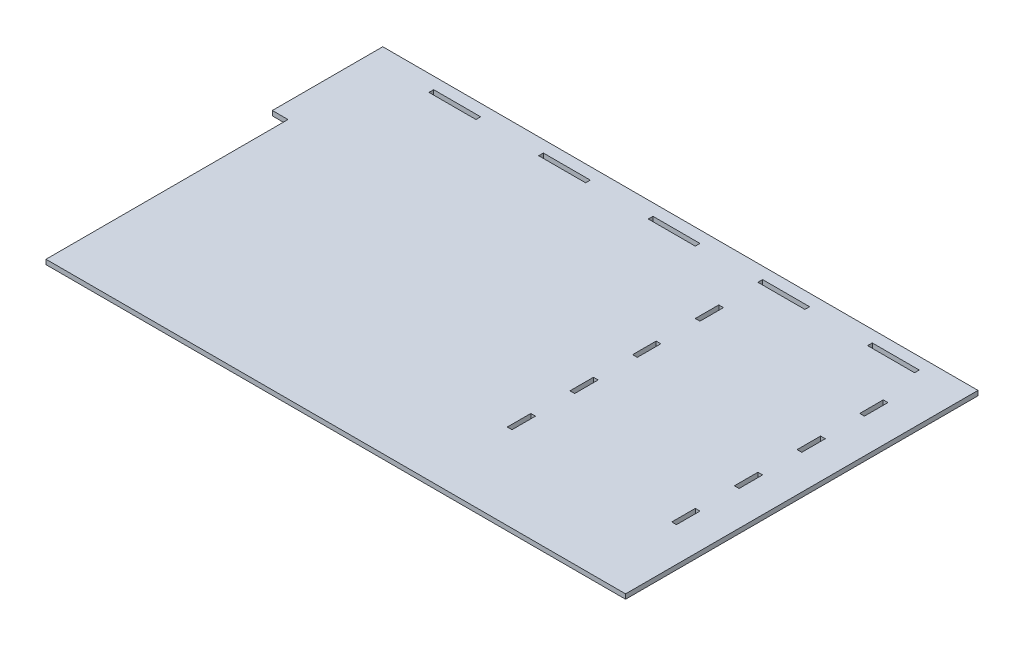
from build123d import *

# Parameters (mm, degrees)
SKETCH1_W           = 390
SKETCH1_H           = 225
BOSS_EXTRUDE1_DEPTH = 3
SKETCH2_W           = 30
SKETCH2_H           = 3
CUT_EXTRUDE1_DEPTH  = 3
SKETCH4_W           = 10
SKETCH4_H           = 225
CUT_EXTRUDE2_DEPTH  = 10
SKETCH9_W           = 10
SKETCH9_H           = 154.5
CUT_EXTRUDE6_DEPTH  = 10
SKETCH10_W          = 3
SKETCH10_H          = 15
CUT_EXTRUDE7_DEPTH  = 10


with BuildPart() as part:
    # Sketch1 → Boss-Extrude1 (new body)
    with BuildSketch(Plane(origin=(0, 0, 0), x_dir=(1, 0, 0), z_dir=(0, 1, 0))):
        with Locations((195, 112.5)):
            Rectangle(SKETCH1_W, SKETCH1_H)
    extrude(amount=BOSS_EXTRUDE1_DEPTH)

    # Sketch2 → Cut-Extrude1 (cut)
    with BuildSketch(Plane(origin=(0, 3, 0), x_dir=(1, 0, 0), z_dir=(0, 1, 0))):
        with Locations((55, 216)):
            Rectangle(SKETCH2_W, SKETCH2_H)
        with Locations((125, 216)):
            Rectangle(SKETCH2_W, SKETCH2_H)
        with Locations((195, 216)):
            Rectangle(SKETCH2_W, SKETCH2_H)
        with Locations((265, 216)):
            Rectangle(SKETCH2_W, SKETCH2_H)
        with Locations((335, 216)):
            Rectangle(SKETCH2_W, SKETCH2_H)
    extrude(amount=-CUT_EXTRUDE1_DEPTH, mode=Mode.SUBTRACT)

    # Sketch4 → Cut-Extrude2 (cut)
    with BuildSketch(Plane(origin=(0, 3, 0), x_dir=(1, 0, 0), z_dir=(0, 1, 0))):
        with Locations((385, 112.5)):
            Rectangle(SKETCH4_W, SKETCH4_H)
    extrude(amount=-CUT_EXTRUDE2_DEPTH, mode=Mode.SUBTRACT)

    # Sketch9 → Cut-Extrude6 (cut)
    with BuildSketch(Plane(origin=(0, 3, 0), x_dir=(1, 0, 0), z_dir=(0, 1, 0))):
        with Locations((5, 77.25)):
            Rectangle(SKETCH9_W, SKETCH9_H)
    extrude(amount=-CUT_EXTRUDE6_DEPTH, mode=Mode.SUBTRACT)

    # Sketch10 → Cut-Extrude7 (cut)
    with BuildSketch(Plane(origin=(0, 3, 0), x_dir=(1, 0, 0), z_dir=(0, 1, 0))):
        with Locations((251.5, 182)):
            Rectangle(SKETCH10_W, SKETCH10_H)
        with Locations((251.5, 142)):
            Rectangle(SKETCH10_W, SKETCH10_H)
        with Locations((251.5, 102)):
            Rectangle(SKETCH10_W, SKETCH10_H)
        with Locations((251.5, 62)):
            Rectangle(SKETCH10_W, SKETCH10_H)
        with Locations((356.5, 62)):
            Rectangle(SKETCH10_W, SKETCH10_H)
        with Locations((356.5, 102)):
            Rectangle(SKETCH10_W, SKETCH10_H)
        with Locations((356.5, 142)):
            Rectangle(SKETCH10_W, SKETCH10_H)
        with Locations((356.5, 182)):
            Rectangle(SKETCH10_W, SKETCH10_H)
    extrude(amount=-CUT_EXTRUDE7_DEPTH, mode=Mode.SUBTRACT)


solid = part.part
